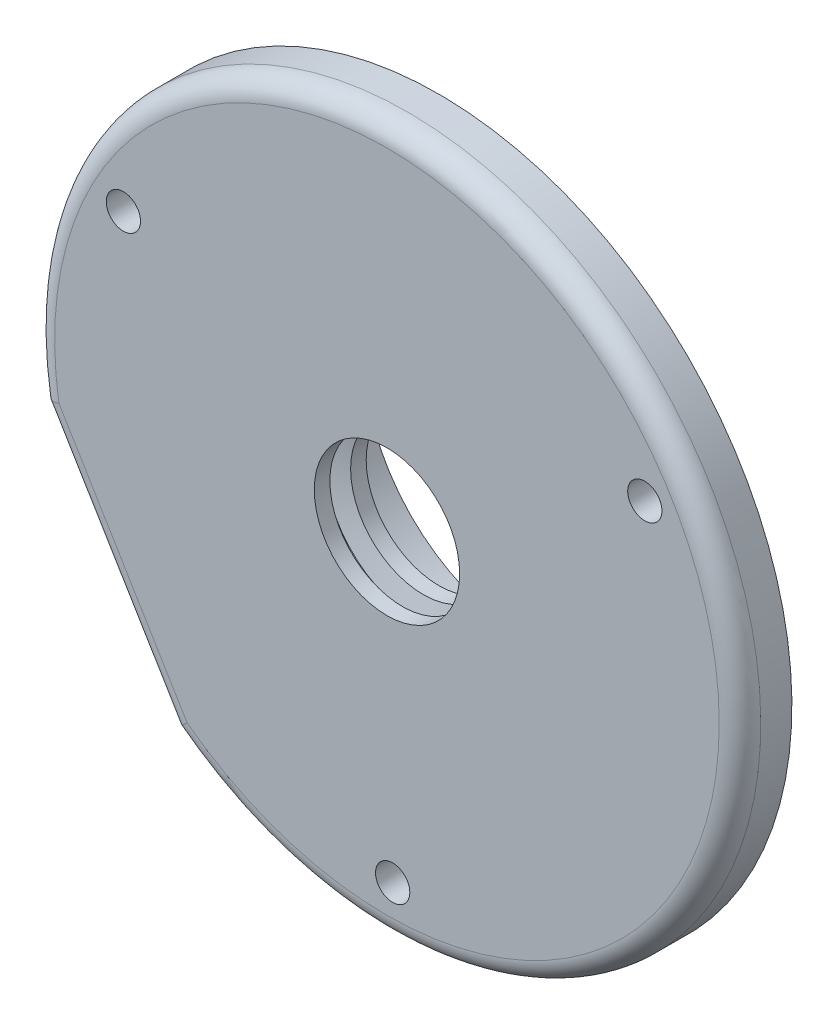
ISO-10303-21;
HEADER;
FILE_DESCRIPTION(('STEP AP214'),'2;1');
FILE_NAME('part.step','',(''),(''),'','','');
FILE_SCHEMA(('AUTOMOTIVE_DESIGN { 1 0 10303 214 1 1 1 1 }'));
ENDSEC;
DATA;
#1=APPLICATION_CONTEXT('core data for automotive mechanical design processes');
#2=APPLICATION_PROTOCOL_DEFINITION('international standard','automotive_design',2000,#1);
#3=PRODUCT_CONTEXT('',#1,'mechanical');
#4=PRODUCT('Part','Part','',(#3));
#5=PRODUCT_RELATED_PRODUCT_CATEGORY('part','',(#4));
#6=PRODUCT_DEFINITION_FORMATION('','',#4);
#7=PRODUCT_DEFINITION_CONTEXT('part definition',#1,'design');
#8=PRODUCT_DEFINITION('design','',#6,#7);
#9=PRODUCT_DEFINITION_SHAPE('','',#8);
#10=(LENGTH_UNIT() NAMED_UNIT(*) SI_UNIT(.MILLI.,.METRE.));
#11=(NAMED_UNIT(*) PLANE_ANGLE_UNIT() SI_UNIT($,.RADIAN.));
#12=(NAMED_UNIT(*) SI_UNIT($,.STERADIAN.) SOLID_ANGLE_UNIT());
#13=UNCERTAINTY_MEASURE_WITH_UNIT(LENGTH_MEASURE(1.E-05),#10,'distance_accuracy_value','');
#14=(GEOMETRIC_REPRESENTATION_CONTEXT(3) GLOBAL_UNCERTAINTY_ASSIGNED_CONTEXT((#13)) GLOBAL_UNIT_ASSIGNED_CONTEXT((#10,
#11,#12)) REPRESENTATION_CONTEXT('',''));
#15=CARTESIAN_POINT('',(0.,0.,0.));
#16=DIRECTION('',(0.,0.,1.));
#17=DIRECTION('',(1.,0.,0.));
#18=AXIS2_PLACEMENT_3D('',#15,#16,#17);
#19=CARTESIAN_POINT('',(0.,0.,13.5));
#20=DIRECTION('',(0.,0.,-1.));
#21=DIRECTION('',(-1.,0.,0.));
#22=AXIS2_PLACEMENT_3D('',#19,#20,#21);
#23=CYLINDRICAL_SURFACE('',#22,7.);
#24=CARTESIAN_POINT('',(0.,0.,8.49999999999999));
#25=DIRECTION('',(0.,0.,1.));
#26=DIRECTION('',(1.,0.,0.));
#27=AXIS2_PLACEMENT_3D('',#24,#25,#26);
#28=CIRCLE('',#27,7.);
#29=CARTESIAN_POINT('',(7.,0.,8.49999999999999));
#30=VERTEX_POINT('',#29);
#31=EDGE_CURVE('E89',#30,#30,#28,.T.);
#32=ORIENTED_EDGE('',*,*,#31,.F.);
#33=EDGE_LOOP('',(#32));
#34=FACE_BOUND('',#33,.T.);
#35=CARTESIAN_POINT('',(0.,0.,9.99999999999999));
#36=DIRECTION('',(0.,0.,-1.));
#37=DIRECTION('',(-1.,0.,0.));
#38=AXIS2_PLACEMENT_3D('',#35,#36,#37);
#39=CIRCLE('',#38,7.);
#40=CARTESIAN_POINT('',(-7.,0.,9.99999999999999));
#41=VERTEX_POINT('',#40);
#42=EDGE_CURVE('E181',#41,#41,#39,.T.);
#43=ORIENTED_EDGE('',*,*,#42,.F.);
#44=EDGE_LOOP('',(#43));
#45=FACE_BOUND('',#44,.T.);
#46=ADVANCED_FACE('F31',(#34,#45),#23,.F.);
#47=CARTESIAN_POINT('',(0.,0.,13.5));
#48=DIRECTION('',(0.,0.,1.));
#49=DIRECTION('',(1.,0.,0.));
#50=AXIS2_PLACEMENT_3D('',#47,#48,#49);
#51=CIRCLE('',#50,7.);
#52=CARTESIAN_POINT('',(7.,0.,13.5));
#53=VERTEX_POINT('',#52);
#54=EDGE_CURVE('E86',#53,#53,#51,.T.);
#55=ORIENTED_EDGE('',*,*,#54,.T.);
#56=EDGE_LOOP('',(#55));
#57=FACE_BOUND('',#56,.T.);
#58=CARTESIAN_POINT('',(0.,0.,12.));
#59=DIRECTION('',(0.,0.,-1.));
#60=DIRECTION('',(-1.,0.,0.));
#61=AXIS2_PLACEMENT_3D('',#58,#59,#60);
#62=CIRCLE('',#61,7.);
#63=CARTESIAN_POINT('',(-7.,0.,12.));
#64=VERTEX_POINT('',#63);
#65=EDGE_CURVE('E179',#64,#64,#62,.T.);
#66=ORIENTED_EDGE('',*,*,#65,.T.);
#67=EDGE_LOOP('',(#66));
#68=FACE_BOUND('',#67,.T.);
#69=ADVANCED_FACE('F125',(#57,#68),#23,.F.);
#70=CARTESIAN_POINT('',(0.,0.,67.0685424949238));
#71=DIRECTION('',(0.,0.,-1.));
#72=DIRECTION('',(-1.,0.,0.));
#73=AXIS2_PLACEMENT_3D('',#70,#71,#72);
#74=CYLINDRICAL_SURFACE('',#73,20.);
#75=CARTESIAN_POINT('',(0.,0.,0.));
#76=DIRECTION('',(0.,0.,1.));
#77=DIRECTION('',(1.,0.,0.));
#78=AXIS2_PLACEMENT_3D('',#75,#76,#77);
#79=CIRCLE('',#78,20.);
#80=CARTESIAN_POINT('',(20.,0.,0.));
#81=VERTEX_POINT('',#80);
#82=EDGE_CURVE('E101',#81,#81,#79,.T.);
#83=ORIENTED_EDGE('',*,*,#82,.T.);
#84=EDGE_LOOP('',(#83));
#85=FACE_BOUND('',#84,.T.);
#86=CARTESIAN_POINT('',(0.,0.,8.49999999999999));
#87=DIRECTION('',(0.,0.,1.));
#88=DIRECTION('',(1.,0.,0.));
#89=AXIS2_PLACEMENT_3D('',#86,#87,#88);
#90=CIRCLE('',#89,20.);
#91=CARTESIAN_POINT('',(20.,0.,8.49999999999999));
#92=VERTEX_POINT('',#91);
#93=EDGE_CURVE('E97',#92,#92,#90,.T.);
#94=ORIENTED_EDGE('',*,*,#93,.F.);
#95=EDGE_LOOP('',(#94));
#96=FACE_BOUND('',#95,.T.);
#97=ADVANCED_FACE('F120',(#85,#96),#74,.T.);
#98=CARTESIAN_POINT('',(0.,0.,0.));
#99=DIRECTION('',(0.,0.,1.));
#100=DIRECTION('',(1.,0.,0.));
#101=AXIS2_PLACEMENT_3D('',#98,#99,#100);
#102=PLANE('',#101);
#103=ORIENTED_EDGE('',*,*,#82,.F.);
#104=EDGE_LOOP('',(#103));
#105=FACE_BOUND('',#104,.T.);
#106=CARTESIAN_POINT('',(0.,0.,0.));
#107=DIRECTION('',(0.,0.,1.));
#108=DIRECTION('',(1.,0.,0.));
#109=AXIS2_PLACEMENT_3D('',#106,#107,#108);
#110=CIRCLE('',#109,15.704);
#111=CARTESIAN_POINT('',(15.704,0.,0.));
#112=VERTEX_POINT('',#111);
#113=EDGE_CURVE('E96',#112,#112,#110,.T.);
#114=ORIENTED_EDGE('',*,*,#113,.T.);
#115=EDGE_LOOP('',(#114));
#116=FACE_BOUND('',#115,.T.);
#117=ADVANCED_FACE('F124',(#105,#116),#102,.F.);
#118=CARTESIAN_POINT('',(0.,0.,67.0685424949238));
#119=DIRECTION('',(0.,0.,-1.));
#120=DIRECTION('',(-1.,0.,0.));
#121=AXIS2_PLACEMENT_3D('',#118,#119,#120);
#122=CYLINDRICAL_SURFACE('',#121,15.704);
#123=ORIENTED_EDGE('',*,*,#113,.F.);
#124=EDGE_LOOP('',(#123));
#125=FACE_BOUND('',#124,.T.);
#126=CARTESIAN_POINT('',(0.,0.,8.49999999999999));
#127=DIRECTION('',(0.,0.,1.));
#128=DIRECTION('',(1.,0.,0.));
#129=AXIS2_PLACEMENT_3D('',#126,#127,#128);
#130=CIRCLE('',#129,15.704);
#131=CARTESIAN_POINT('',(15.704,0.,8.49999999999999));
#132=VERTEX_POINT('',#131);
#133=EDGE_CURVE('E77',#132,#132,#130,.T.);
#134=ORIENTED_EDGE('',*,*,#133,.T.);
#135=EDGE_LOOP('',(#134));
#136=FACE_BOUND('',#135,.T.);
#137=ADVANCED_FACE('F129',(#125,#136),#122,.F.);
#138=CARTESIAN_POINT('',(0.,0.,8.49999999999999));
#139=DIRECTION('',(0.,0.,1.));
#140=DIRECTION('',(1.,0.,0.));
#141=AXIS2_PLACEMENT_3D('',#138,#139,#140);
#142=PLANE('',#141);
#143=CARTESIAN_POINT('',(-25.3854193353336,14.0207162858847,8.49999999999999));
#144=DIRECTION('',(0.,0.,1.));
#145=DIRECTION('',(1.,0.,0.));
#146=AXIS2_PLACEMENT_3D('',#143,#144,#145);
#147=CIRCLE('',#146,1.64999999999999);
#148=CARTESIAN_POINT('',(-23.7354193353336,14.0207162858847,8.49999999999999));
#149=VERTEX_POINT('',#148);
#150=EDGE_CURVE('E192',#149,#149,#147,.T.);
#151=ORIENTED_EDGE('',*,*,#150,.T.);
#152=EDGE_LOOP('',(#151));
#153=FACE_BOUND('',#152,.T.);
#154=CARTESIAN_POINT('',(24.835006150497,14.9740598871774,8.49999999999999));
#155=DIRECTION('',(0.,0.,1.));
#156=DIRECTION('',(1.,0.,0.));
#157=AXIS2_PLACEMENT_3D('',#154,#155,#156);
#158=CIRCLE('',#157,1.64999999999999);
#159=CARTESIAN_POINT('',(26.485006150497,14.9740598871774,8.49999999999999));
#160=VERTEX_POINT('',#159);
#161=EDGE_CURVE('E198',#160,#160,#158,.T.);
#162=ORIENTED_EDGE('',*,*,#161,.T.);
#163=EDGE_LOOP('',(#162));
#164=FACE_BOUND('',#163,.T.);
#165=CARTESIAN_POINT('',(0.550413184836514,-28.9947761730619,8.49999999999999));
#166=DIRECTION('',(0.,0.,1.));
#167=DIRECTION('',(1.,0.,0.));
#168=AXIS2_PLACEMENT_3D('',#165,#166,#167);
#169=CIRCLE('',#168,1.64999999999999);
#170=CARTESIAN_POINT('',(2.20041318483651,-28.9947761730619,8.49999999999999));
#171=VERTEX_POINT('',#170);
#172=EDGE_CURVE('E204',#171,#171,#169,.T.);
#173=ORIENTED_EDGE('',*,*,#172,.T.);
#174=EDGE_LOOP('',(#173));
#175=FACE_BOUND('',#174,.T.);
#176=CARTESIAN_POINT('',(0.,0.,8.49999999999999));
#177=DIRECTION('',(0.,0.,1.));
#178=DIRECTION('',(1.,0.,0.));
#179=AXIS2_PLACEMENT_3D('',#176,#177,#178);
#180=CIRCLE('',#179,34.);
#181=CARTESIAN_POINT('',(-20.7585058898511,-26.9273918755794,8.49999999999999));
#182=VERTEX_POINT('',#181);
#183=CARTESIAN_POINT('',(-33.5034724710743,-5.78941554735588,8.49999999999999));
#184=VERTEX_POINT('',#183);
#185=EDGE_CURVE('E83',#182,#184,#180,.T.);
#186=ORIENTED_EDGE('',*,*,#185,.F.);
#187=DIRECTION('',(0.51634689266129,-0.856379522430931,0.));
#188=VECTOR('',#187,1.);
#189=CARTESIAN_POINT('',(-33.5034724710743,-5.78941554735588,8.49999999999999));
#190=LINE('',#189,#188);
#191=EDGE_CURVE('E74',#184,#182,#190,.T.);
#192=ORIENTED_EDGE('',*,*,#191,.F.);
#193=EDGE_LOOP('',(#186,#192));
#194=FACE_BOUND('',#193,.T.);
#195=ORIENTED_EDGE('',*,*,#93,.T.);
#196=EDGE_LOOP('',(#195));
#197=FACE_BOUND('',#196,.T.);
#198=ADVANCED_FACE('F81',(#153,#164,#175,#194,#197),#142,.F.);
#199=CARTESIAN_POINT('',(0.,0.,13.5));
#200=DIRECTION('',(0.,0.,1.));
#201=DIRECTION('',(1.,0.,0.));
#202=AXIS2_PLACEMENT_3D('',#199,#200,#201);
#203=PLANE('',#202);
#204=CARTESIAN_POINT('',(0.,0.,13.5));
#205=DIRECTION('',(0.,0.,1.));
#206=DIRECTION('',(1.,0.,0.));
#207=AXIS2_PLACEMENT_3D('',#204,#205,#206);
#208=CIRCLE('',#207,32.);
#209=CARTESIAN_POINT('',(-19.242838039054,-25.5678153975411,13.5));
#210=VERTEX_POINT('',#209);
#211=CARTESIAN_POINT('',(-31.5936222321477,-5.08360445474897,13.5));
#212=VERTEX_POINT('',#211);
#213=EDGE_CURVE('E100',#210,#212,#208,.T.);
#214=ORIENTED_EDGE('',*,*,#213,.T.);
#215=DIRECTION('',(0.51634689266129,-0.856379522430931,0.));
#216=VECTOR('',#215,1.);
#217=CARTESIAN_POINT('',(-19.0457468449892,-25.8946980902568,13.5));
#218=LINE('',#217,#216);
#219=EDGE_CURVE('E107',#212,#210,#218,.T.);
#220=ORIENTED_EDGE('',*,*,#219,.T.);
#221=EDGE_LOOP('',(#214,#220));
#222=FACE_BOUND('',#221,.T.);
#223=CARTESIAN_POINT('',(-25.3854193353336,14.0207162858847,13.5));
#224=DIRECTION('',(0.,0.,1.));
#225=DIRECTION('',(1.,0.,0.));
#226=AXIS2_PLACEMENT_3D('',#223,#224,#225);
#227=CIRCLE('',#226,1.64999999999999);
#228=CARTESIAN_POINT('',(-23.7354193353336,14.0207162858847,13.5));
#229=VERTEX_POINT('',#228);
#230=EDGE_CURVE('E189',#229,#229,#227,.T.);
#231=ORIENTED_EDGE('',*,*,#230,.F.);
#232=EDGE_LOOP('',(#231));
#233=FACE_BOUND('',#232,.T.);
#234=CARTESIAN_POINT('',(24.835006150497,14.9740598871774,13.5));
#235=DIRECTION('',(0.,0.,1.));
#236=DIRECTION('',(1.,0.,0.));
#237=AXIS2_PLACEMENT_3D('',#234,#235,#236);
#238=CIRCLE('',#237,1.64999999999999);
#239=CARTESIAN_POINT('',(26.485006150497,14.9740598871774,13.5));
#240=VERTEX_POINT('',#239);
#241=EDGE_CURVE('E195',#240,#240,#238,.T.);
#242=ORIENTED_EDGE('',*,*,#241,.F.);
#243=EDGE_LOOP('',(#242));
#244=FACE_BOUND('',#243,.T.);
#245=CARTESIAN_POINT('',(0.550413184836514,-28.9947761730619,13.5));
#246=DIRECTION('',(0.,0.,1.));
#247=DIRECTION('',(1.,0.,0.));
#248=AXIS2_PLACEMENT_3D('',#245,#246,#247);
#249=CIRCLE('',#248,1.64999999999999);
#250=CARTESIAN_POINT('',(2.2004131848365,-28.9947761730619,13.5));
#251=VERTEX_POINT('',#250);
#252=EDGE_CURVE('E201',#251,#251,#249,.T.);
#253=ORIENTED_EDGE('',*,*,#252,.F.);
#254=EDGE_LOOP('',(#253));
#255=FACE_BOUND('',#254,.T.);
#256=ORIENTED_EDGE('',*,*,#54,.F.);
#257=EDGE_LOOP('',(#256));
#258=FACE_BOUND('',#257,.T.);
#259=ADVANCED_FACE('F142',(#222,#233,#244,#255,#258),#203,.T.);
#260=ORIENTED_EDGE('',*,*,#133,.F.);
#261=EDGE_LOOP('',(#260));
#262=FACE_BOUND('',#261,.T.);
#263=ORIENTED_EDGE('',*,*,#31,.T.);
#264=EDGE_LOOP('',(#263));
#265=FACE_BOUND('',#264,.T.);
#266=ADVANCED_FACE('F136',(#262,#265),#142,.F.);
#267=CARTESIAN_POINT('',(0.,0.,13.5));
#268=DIRECTION('',(0.,0.,-1.));
#269=DIRECTION('',(-1.,0.,0.));
#270=AXIS2_PLACEMENT_3D('',#267,#268,#269);
#271=CYLINDRICAL_SURFACE('',#270,34.);
#272=DIRECTION('',(0.,0.,-1.));
#273=VECTOR('',#272,1.);
#274=CARTESIAN_POINT('',(-33.5034724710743,-5.78941554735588,13.5));
#275=LINE('',#274,#273);
#276=CARTESIAN_POINT('',(-33.5034724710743,-5.78941554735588,11.5));
#277=VERTEX_POINT('',#276);
#278=EDGE_CURVE('E71',#277,#184,#275,.T.);
#279=ORIENTED_EDGE('',*,*,#278,.F.);
#280=CARTESIAN_POINT('',(0.,0.,11.5));
#281=DIRECTION('',(0.,0.,1.));
#282=DIRECTION('',(1.,0.,0.));
#283=AXIS2_PLACEMENT_3D('',#280,#281,#282);
#284=CIRCLE('',#283,34.);
#285=CARTESIAN_POINT('',(-20.7585058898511,-26.9273918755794,11.5));
#286=VERTEX_POINT('',#285);
#287=EDGE_CURVE('E11',#277,#286,#284,.F.);
#288=ORIENTED_EDGE('',*,*,#287,.T.);
#289=DIRECTION('',(0.,0.,-1.));
#290=VECTOR('',#289,1.);
#291=CARTESIAN_POINT('',(-20.7585058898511,-26.9273918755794,13.5));
#292=LINE('',#291,#290);
#293=EDGE_CURVE('E78',#286,#182,#292,.T.);
#294=ORIENTED_EDGE('',*,*,#293,.T.);
#295=ORIENTED_EDGE('',*,*,#185,.T.);
#296=EDGE_LOOP('',(#279,#288,#294,#295));
#297=FACE_BOUND('',#296,.T.);
#298=ADVANCED_FACE('F85',(#297),#271,.T.);
#299=CARTESIAN_POINT('',(-33.5034724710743,-5.78941554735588,13.5));
#300=DIRECTION('',(0.856379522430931,0.51634689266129,0.));
#301=DIRECTION('',(-0.51634689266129,0.856379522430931,0.));
#302=AXIS2_PLACEMENT_3D('',#299,#300,#301);
#303=PLANE('',#302);
#304=ORIENTED_EDGE('',*,*,#293,.F.);
#305=DIRECTION('',(0.51634689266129,-0.856379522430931,0.));
#306=VECTOR('',#305,1.);
#307=CARTESIAN_POINT('',(-33.5034724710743,-5.78941554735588,11.5));
#308=LINE('',#307,#306);
#309=EDGE_CURVE('E44',#286,#277,#308,.F.);
#310=ORIENTED_EDGE('',*,*,#309,.T.);
#311=ORIENTED_EDGE('',*,*,#278,.T.);
#312=ORIENTED_EDGE('',*,*,#191,.T.);
#313=EDGE_LOOP('',(#304,#310,#311,#312));
#314=FACE_BOUND('',#313,.T.);
#315=ADVANCED_FACE('F73',(#314),#303,.F.);
#316=CARTESIAN_POINT('',(0.550413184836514,-28.9947761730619,13.5));
#317=DIRECTION('',(0.,0.,1.));
#318=DIRECTION('',(1.,0.,0.));
#319=AXIS2_PLACEMENT_3D('',#316,#317,#318);
#320=CYLINDRICAL_SURFACE('',#319,1.64999999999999);
#321=ORIENTED_EDGE('',*,*,#252,.T.);
#322=EDGE_LOOP('',(#321));
#323=FACE_BOUND('',#322,.T.);
#324=ORIENTED_EDGE('',*,*,#172,.F.);
#325=EDGE_LOOP('',(#324));
#326=FACE_BOUND('',#325,.T.);
#327=ADVANCED_FACE('F139',(#323,#326),#320,.F.);
#328=CARTESIAN_POINT('',(24.835006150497,14.9740598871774,13.5));
#329=DIRECTION('',(0.,0.,1.));
#330=DIRECTION('',(1.,0.,0.));
#331=AXIS2_PLACEMENT_3D('',#328,#329,#330);
#332=CYLINDRICAL_SURFACE('',#331,1.64999999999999);
#333=ORIENTED_EDGE('',*,*,#241,.T.);
#334=EDGE_LOOP('',(#333));
#335=FACE_BOUND('',#334,.T.);
#336=ORIENTED_EDGE('',*,*,#161,.F.);
#337=EDGE_LOOP('',(#336));
#338=FACE_BOUND('',#337,.T.);
#339=ADVANCED_FACE('F152',(#335,#338),#332,.F.);
#340=CARTESIAN_POINT('',(-25.3854193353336,14.0207162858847,13.5));
#341=DIRECTION('',(0.,0.,1.));
#342=DIRECTION('',(1.,0.,0.));
#343=AXIS2_PLACEMENT_3D('',#340,#341,#342);
#344=CYLINDRICAL_SURFACE('',#343,1.64999999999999);
#345=ORIENTED_EDGE('',*,*,#230,.T.);
#346=EDGE_LOOP('',(#345));
#347=FACE_BOUND('',#346,.T.);
#348=ORIENTED_EDGE('',*,*,#150,.F.);
#349=EDGE_LOOP('',(#348));
#350=FACE_BOUND('',#349,.T.);
#351=ADVANCED_FACE('F156',(#347,#350),#344,.F.);
#352=CARTESIAN_POINT('',(0.,0.,11.5));
#353=DIRECTION('',(0.,0.,1.));
#354=DIRECTION('',(1.,0.,0.));
#355=AXIS2_PLACEMENT_3D('',#352,#353,#354);
#356=TOROIDAL_SURFACE('',#355,32.,2.);
#357=CARTESIAN_POINT('',(-20.7585058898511,-26.9273918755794,11.5));
#358=CARTESIAN_POINT('',(-20.7585060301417,-26.9273919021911,11.5555593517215));
#359=CARTESIAN_POINT('',(-20.7567467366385,-26.9258229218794,11.6110918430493));
#360=CARTESIAN_POINT('',(-20.7497310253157,-26.9195655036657,11.7217541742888));
#361=CARTESIAN_POINT('',(-20.7444748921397,-26.9148773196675,11.7768840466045));
#362=CARTESIAN_POINT('',(-20.723522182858,-26.896187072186,11.9409347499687));
#363=CARTESIAN_POINT('',(-20.7026410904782,-26.8775591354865,12.048748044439));
#364=CARTESIAN_POINT('',(-20.6476987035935,-26.8285267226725,12.2581287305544));
#365=CARTESIAN_POINT('',(-20.6136333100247,-26.7981185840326,12.3596941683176));
#366=CARTESIAN_POINT('',(-20.5333768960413,-26.7264413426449,12.553795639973));
#367=CARTESIAN_POINT('',(-20.487187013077,-26.6851732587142,12.6463325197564));
#368=CARTESIAN_POINT('',(-20.3836909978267,-26.592645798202,12.8205221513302));
#369=CARTESIAN_POINT('',(-20.3263058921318,-26.5413154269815,12.9020901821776));
#370=CARTESIAN_POINT('',(-20.2023147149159,-26.4303221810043,13.0514181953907));
#371=CARTESIAN_POINT('',(-20.1357056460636,-26.3706565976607,13.1191736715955));
#372=CARTESIAN_POINT('',(-19.9940258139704,-26.2436372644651,13.2401206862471));
#373=CARTESIAN_POINT('',(-19.9188334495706,-26.1761727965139,13.2930531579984));
#374=CARTESIAN_POINT('',(-19.7630565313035,-26.0362734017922,13.3814892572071));
#375=CARTESIAN_POINT('',(-19.6824746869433,-25.9638409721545,13.4170015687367));
#376=CARTESIAN_POINT('',(-19.5435397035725,-25.8388324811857,13.4616359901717));
#377=CARTESIAN_POINT('',(-19.4859815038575,-25.7870092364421,13.4755169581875));
#378=CARTESIAN_POINT('',(-19.370165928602,-25.6826602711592,13.4943887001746));
#379=CARTESIAN_POINT('',(-19.3119099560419,-25.6301359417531,13.4993950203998));
#380=CARTESIAN_POINT('',(-19.2500794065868,-25.5743493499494,13.4999828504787));
#381=CARTESIAN_POINT('',(-19.2464585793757,-25.571082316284,13.5000000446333));
#382=CARTESIAN_POINT('',(-19.242838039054,-25.5678153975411,13.5));
#383=B_SPLINE_CURVE_WITH_KNOTS('',3,(#357,#358,#359,#360,#361,#362,#363,#364,#365,#366,#367,
#368,#369,#370,#371,#372,#373,#374,#375,#376,#377,#378,#379,#380,#381,#382),.UNSPECIFIED.,.F.,
.F.,(4,2,2,2,2,2,2,2,2,2,2,2,4),(0.,0.166574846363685,0.333136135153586,0.665573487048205,
0.998114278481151,1.33062388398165,1.66556992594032,2.00062506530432,2.34121490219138,
2.68163477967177,2.91724180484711,3.15243569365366,3.16706626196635),.UNSPECIFIED.);
#384=EDGE_CURVE('E110',#286,#210,#383,.T.);
#385=ORIENTED_EDGE('',*,*,#384,.F.);
#386=ORIENTED_EDGE('',*,*,#287,.F.);
#387=CARTESIAN_POINT('',(-33.5034724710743,-5.78941554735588,11.5));
#388=CARTESIAN_POINT('',(-33.5034725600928,-5.78941565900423,11.5555593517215));
#389=CARTESIAN_POINT('',(-33.5012638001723,-5.78859213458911,11.6110918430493));
#390=CARTESIAN_POINT('',(-33.4924551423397,-5.78530838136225,11.7217541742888));
#391=CARTESIAN_POINT('',(-33.4858556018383,-5.7828482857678,11.7768840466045));
#392=CARTESIAN_POINT('',(-33.4595462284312,-5.77304225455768,11.9409347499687));
#393=CARTESIAN_POINT('',(-33.4333253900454,-5.76327047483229,12.048748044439));
#394=CARTESIAN_POINT('',(-33.3643166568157,-5.73756759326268,12.2581287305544));
#395=CARTESIAN_POINT('',(-33.3215236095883,-5.72163457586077,12.3596941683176));
#396=CARTESIAN_POINT('',(-33.2206724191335,-5.68411449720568,12.553795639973));
#397=CARTESIAN_POINT('',(-33.1626157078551,-5.66252796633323,12.6463325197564));
#398=CARTESIAN_POINT('',(-33.0324774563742,-5.61418759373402,12.8205221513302));
#399=CARTESIAN_POINT('',(-32.9602962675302,-5.58739704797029,12.9020901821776));
#400=CARTESIAN_POINT('',(-32.8042607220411,-5.52955051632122,13.0514181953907));
#401=CARTESIAN_POINT('',(-32.720402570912,-5.49849314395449,13.1191736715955));
#402=CARTESIAN_POINT('',(-32.5419373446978,-5.43248368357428,13.2401206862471));
#403=CARTESIAN_POINT('',(-32.4471755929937,-5.39747573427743,13.2930531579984));
#404=CARTESIAN_POINT('',(-32.2507394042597,-5.32501117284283,13.3814892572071));
#405=CARTESIAN_POINT('',(-32.1490684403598,-5.28755579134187,13.4170015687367));
#406=CARTESIAN_POINT('',(-31.9736627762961,-5.22303520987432,13.4616359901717));
#407=CARTESIAN_POINT('',(-31.9009649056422,-5.19632164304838,13.4755169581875));
#408=CARTESIAN_POINT('',(-31.7546215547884,-5.14260406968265,13.4943887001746));
#409=CARTESIAN_POINT('',(-31.6809779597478,-5.11560065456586,13.4993950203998));
#410=CARTESIAN_POINT('',(-31.6027807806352,-5.08695869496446,13.4999828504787));
#411=CARTESIAN_POINT('',(-31.598201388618,-5.08528147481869,13.5000000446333));
#412=CARTESIAN_POINT('',(-31.5936222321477,-5.08360445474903,13.5));
#413=B_SPLINE_CURVE_WITH_KNOTS('',3,(#387,#388,#389,#390,#391,#392,#393,#394,#395,#396,#397,
#398,#399,#400,#401,#402,#403,#404,#405,#406,#407,#408,#409,#410,#411,#412),.UNSPECIFIED.,.F.,
.F.,(4,2,2,2,2,2,2,2,2,2,2,2,4),(0.,0.166574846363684,0.333136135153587,0.665573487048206,
0.998114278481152,1.33062388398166,1.66556992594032,2.00062506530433,2.34121490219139,
2.68163477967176,2.91724180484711,3.15243569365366,3.16706626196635),.UNSPECIFIED.);
#414=EDGE_CURVE('E36',#212,#277,#413,.F.);
#415=ORIENTED_EDGE('',*,*,#414,.F.);
#416=ORIENTED_EDGE('',*,*,#213,.F.);
#417=EDGE_LOOP('',(#385,#386,#415,#416));
#418=FACE_BOUND('',#417,.T.);
#419=ADVANCED_FACE('F33',(#418),#356,.T.);
#420=CARTESIAN_POINT('',(-25.4182301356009,-15.325709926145,11.5));
#421=DIRECTION('',(-0.51634689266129,0.856379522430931,0.));
#422=DIRECTION('',(-0.856379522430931,-0.51634689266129,0.));
#423=AXIS2_PLACEMENT_3D('',#420,#421,#422);
#424=CYLINDRICAL_SURFACE('',#423,2.);
#425=ORIENTED_EDGE('',*,*,#414,.T.);
#426=ORIENTED_EDGE('',*,*,#309,.F.);
#427=ORIENTED_EDGE('',*,*,#384,.T.);
#428=ORIENTED_EDGE('',*,*,#219,.F.);
#429=EDGE_LOOP('',(#425,#426,#427,#428));
#430=FACE_BOUND('',#429,.T.);
#431=ADVANCED_FACE('F115',(#430),#424,.T.);
#432=CARTESIAN_POINT('',(0.,0.,10.5));
#433=DIRECTION('',(0.,0.,1.));
#434=DIRECTION('',(1.,0.,0.));
#435=AXIS2_PLACEMENT_3D('',#432,#433,#434);
#436=CONICAL_SURFACE('',#435,9.,1.32581766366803);
#437=ORIENTED_EDGE('',*,*,#42,.T.);
#438=EDGE_LOOP('',(#437));
#439=FACE_BOUND('',#438,.T.);
#440=CARTESIAN_POINT('',(0.,0.,10.5));
#441=DIRECTION('',(0.,0.,-1.));
#442=DIRECTION('',(-1.,0.,0.));
#443=AXIS2_PLACEMENT_3D('',#440,#441,#442);
#444=CIRCLE('',#443,9.);
#445=CARTESIAN_POINT('',(-9.,0.,10.5));
#446=VERTEX_POINT('',#445);
#447=EDGE_CURVE('E114',#446,#446,#444,.T.);
#448=ORIENTED_EDGE('',*,*,#447,.F.);
#449=EDGE_LOOP('',(#448));
#450=FACE_BOUND('',#449,.T.);
#451=ADVANCED_FACE('F119',(#439,#450),#436,.F.);
#452=CARTESIAN_POINT('',(0.,0.,0.));
#453=DIRECTION('',(0.,0.,-1.));
#454=DIRECTION('',(-1.,0.,0.));
#455=AXIS2_PLACEMENT_3D('',#452,#453,#454);
#456=CYLINDRICAL_SURFACE('',#455,9.);
#457=ORIENTED_EDGE('',*,*,#447,.T.);
#458=EDGE_LOOP('',(#457));
#459=FACE_BOUND('',#458,.T.);
#460=CARTESIAN_POINT('',(0.,0.,11.5));
#461=DIRECTION('',(0.,0.,-1.));
#462=DIRECTION('',(-1.,0.,0.));
#463=AXIS2_PLACEMENT_3D('',#460,#461,#462);
#464=CIRCLE('',#463,9.);
#465=CARTESIAN_POINT('',(-9.,0.,11.5));
#466=VERTEX_POINT('',#465);
#467=EDGE_CURVE('E176',#466,#466,#464,.T.);
#468=ORIENTED_EDGE('',*,*,#467,.F.);
#469=EDGE_LOOP('',(#468));
#470=FACE_BOUND('',#469,.T.);
#471=ADVANCED_FACE('F163',(#459,#470),#456,.F.);
#472=CARTESIAN_POINT('',(0.,0.,12.));
#473=DIRECTION('',(0.,0.,-1.));
#474=DIRECTION('',(-1.,0.,0.));
#475=AXIS2_PLACEMENT_3D('',#472,#473,#474);
#476=CONICAL_SURFACE('',#475,7.,1.32581766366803);
#477=ORIENTED_EDGE('',*,*,#467,.T.);
#478=EDGE_LOOP('',(#477));
#479=FACE_BOUND('',#478,.T.);
#480=ORIENTED_EDGE('',*,*,#65,.F.);
#481=EDGE_LOOP('',(#480));
#482=FACE_BOUND('',#481,.T.);
#483=ADVANCED_FACE('F167',(#479,#482),#476,.F.);
#484=CLOSED_SHELL('',(#46,#69,#97,#117,#137,#198,#259,#266,#298,#315,#327,#339,#351,#419,#431,
#451,#471,#483));
#485=MANIFOLD_SOLID_BREP('B2',#484);
#486=ADVANCED_BREP_SHAPE_REPRESENTATION('',(#18,#485),#14);
#487=SHAPE_DEFINITION_REPRESENTATION(#9,#486);
ENDSEC;
END-ISO-10303-21;
